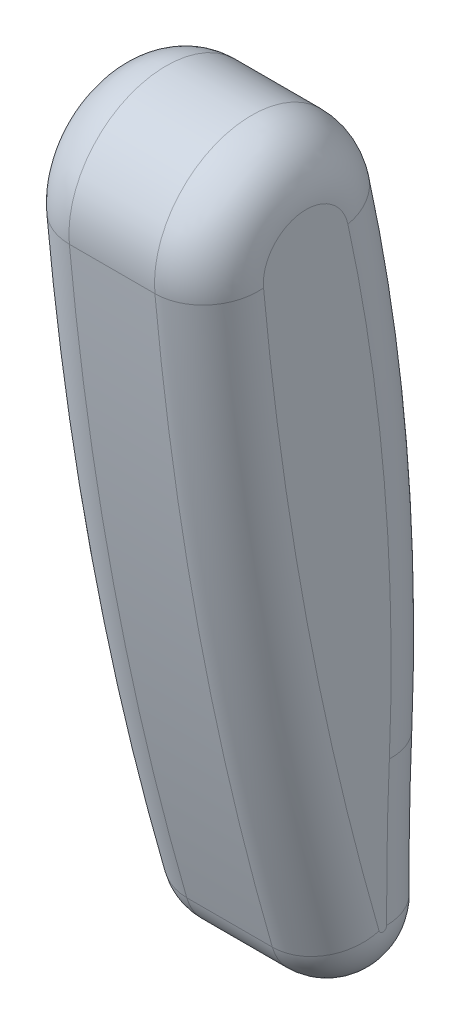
ISO-10303-21;
HEADER;
FILE_DESCRIPTION(('STEP AP214'),'2;1');
FILE_NAME('part.step','',(''),(''),'','','');
FILE_SCHEMA(('AUTOMOTIVE_DESIGN { 1 0 10303 214 1 1 1 1 }'));
ENDSEC;
DATA;
#1=APPLICATION_CONTEXT('core data for automotive mechanical design processes');
#2=APPLICATION_PROTOCOL_DEFINITION('international standard','automotive_design',2000,#1);
#3=PRODUCT_CONTEXT('',#1,'mechanical');
#4=PRODUCT('Part','Part','',(#3));
#5=PRODUCT_RELATED_PRODUCT_CATEGORY('part','',(#4));
#6=PRODUCT_DEFINITION_FORMATION('','',#4);
#7=PRODUCT_DEFINITION_CONTEXT('part definition',#1,'design');
#8=PRODUCT_DEFINITION('design','',#6,#7);
#9=PRODUCT_DEFINITION_SHAPE('','',#8);
#10=(LENGTH_UNIT() NAMED_UNIT(*) SI_UNIT(.MILLI.,.METRE.));
#11=(NAMED_UNIT(*) PLANE_ANGLE_UNIT() SI_UNIT($,.RADIAN.));
#12=(NAMED_UNIT(*) SI_UNIT($,.STERADIAN.) SOLID_ANGLE_UNIT());
#13=UNCERTAINTY_MEASURE_WITH_UNIT(LENGTH_MEASURE(1.E-05),#10,'distance_accuracy_value','');
#14=(GEOMETRIC_REPRESENTATION_CONTEXT(3) GLOBAL_UNCERTAINTY_ASSIGNED_CONTEXT((#13)) GLOBAL_UNIT_ASSIGNED_CONTEXT((#10,
#11,#12)) REPRESENTATION_CONTEXT('',''));
#15=CARTESIAN_POINT('',(0.,0.,0.));
#16=DIRECTION('',(0.,0.,1.));
#17=DIRECTION('',(1.,0.,0.));
#18=AXIS2_PLACEMENT_3D('',#15,#16,#17);
#19=CARTESIAN_POINT('',(-50.8,-559.10903574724,-2113.11328138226));
#20=DIRECTION('',(-1.,0.,0.));
#21=DIRECTION('',(0.,0.,-1.));
#22=AXIS2_PLACEMENT_3D('',#19,#20,#21);
#23=CYLINDRICAL_SURFACE('',#22,2209.8);
#24=DIRECTION('',(-1.,0.,0.));
#25=VECTOR('',#24,1.);
#26=CARTESIAN_POINT('',(-50.8,-761.528986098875,87.3962513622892));
#27=LINE('',#26,#25);
#28=CARTESIAN_POINT('',(-86.36,-761.528986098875,87.3962513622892));
#29=VERTEX_POINT('',#28);
#30=CARTESIAN_POINT('',(-142.24,-761.528986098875,87.3962513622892));
#31=VERTEX_POINT('',#30);
#32=EDGE_CURVE('E146',#29,#31,#27,.T.);
#33=ORIENTED_EDGE('',*,*,#32,.T.);
#34=CARTESIAN_POINT('',(-142.24,-559.10903574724,-2113.11328138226));
#35=DIRECTION('',(-1.,0.,0.));
#36=DIRECTION('',(0.,0.,1.));
#37=AXIS2_PLACEMENT_3D('',#34,#35,#36);
#38=CIRCLE('',#37,2209.8);
#39=CARTESIAN_POINT('',(-142.24,-1169.53967872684,10.7017929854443));
#40=VERTEX_POINT('',#39);
#41=EDGE_CURVE('E190',#40,#31,#38,.T.);
#42=ORIENTED_EDGE('',*,*,#41,.F.);
#43=DIRECTION('',(-1.,0.,0.));
#44=VECTOR('',#43,1.);
#45=CARTESIAN_POINT('',(-50.8,-1169.53967872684,10.7017929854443));
#46=LINE('',#45,#44);
#47=CARTESIAN_POINT('',(-86.36,-1169.53967872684,10.7017929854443));
#48=VERTEX_POINT('',#47);
#49=EDGE_CURVE('E162',#48,#40,#46,.T.);
#50=ORIENTED_EDGE('',*,*,#49,.F.);
#51=CARTESIAN_POINT('',(-86.36,-559.10903574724,-2113.11328138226));
#52=DIRECTION('',(-1.,0.,0.));
#53=DIRECTION('',(0.,0.,1.));
#54=AXIS2_PLACEMENT_3D('',#51,#52,#53);
#55=CIRCLE('',#54,2209.8);
#56=EDGE_CURVE('E193',#29,#48,#55,.F.);
#57=ORIENTED_EDGE('',*,*,#56,.F.);
#58=EDGE_LOOP('',(#33,#42,#50,#57));
#59=FACE_BOUND('',#58,.T.);
#60=ADVANCED_FACE('F35',(#59),#23,.T.);
#61=CARTESIAN_POINT('',(-50.8,-755.712320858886,24.1632188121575));
#62=DIRECTION('',(-1.,0.,0.));
#63=DIRECTION('',(0.,0.,-1.));
#64=AXIS2_PLACEMENT_3D('',#61,#62,#63);
#65=CYLINDRICAL_SURFACE('',#64,63.5000000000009);
#66=DIRECTION('',(-1.,0.,0.));
#67=VECTOR('',#66,1.);
#68=CARTESIAN_POINT('',(-50.8,-742.213802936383,-37.8854718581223));
#69=LINE('',#68,#67);
#70=CARTESIAN_POINT('',(-86.36,-742.213802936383,-37.8854718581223));
#71=VERTEX_POINT('',#70);
#72=CARTESIAN_POINT('',(-142.24,-742.213802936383,-37.8854718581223));
#73=VERTEX_POINT('',#72);
#74=EDGE_CURVE('E144',#71,#73,#69,.T.);
#75=ORIENTED_EDGE('',*,*,#74,.T.);
#76=CARTESIAN_POINT('',(-142.24,-755.712320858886,24.1632188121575));
#77=DIRECTION('',(-1.,0.,0.));
#78=DIRECTION('',(0.,0.,1.));
#79=AXIS2_PLACEMENT_3D('',#76,#77,#78);
#80=CIRCLE('',#79,63.5000000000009);
#81=EDGE_CURVE('E148',#31,#73,#80,.T.);
#82=ORIENTED_EDGE('',*,*,#81,.F.);
#83=ORIENTED_EDGE('',*,*,#32,.F.);
#84=CARTESIAN_POINT('',(-86.36,-755.712320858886,24.1632188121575));
#85=DIRECTION('',(-1.,0.,0.));
#86=DIRECTION('',(0.,0.,1.));
#87=AXIS2_PLACEMENT_3D('',#84,#85,#86);
#88=CIRCLE('',#87,63.5000000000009);
#89=EDGE_CURVE('E118',#71,#29,#88,.F.);
#90=ORIENTED_EDGE('',*,*,#89,.F.);
#91=EDGE_LOOP('',(#75,#82,#83,#90));
#92=FACE_BOUND('',#91,.T.);
#93=ADVANCED_FACE('F142',(#92),#65,.T.);
#94=CARTESIAN_POINT('',(-50.8,-1012.18416138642,1203.08834154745));
#95=DIRECTION('',(-1.,0.,0.));
#96=DIRECTION('',(0.,0.,-1.));
#97=AXIS2_PLACEMENT_3D('',#94,#95,#96);
#98=CYLINDRICAL_SURFACE('',#97,1270.);
#99=DIRECTION('',(-1.,0.,0.));
#100=VECTOR('',#99,1.);
#101=CARTESIAN_POINT('',(-50.8,-1067.28642691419,-65.7157175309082));
#102=LINE('',#101,#100);
#103=CARTESIAN_POINT('',(-86.36,-1067.28642691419,-65.7157175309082));
#104=VERTEX_POINT('',#103);
#105=CARTESIAN_POINT('',(-142.24,-1067.28642691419,-65.7157175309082));
#106=VERTEX_POINT('',#105);
#107=EDGE_CURVE('E154',#104,#106,#102,.T.);
#108=ORIENTED_EDGE('',*,*,#107,.T.);
#109=CARTESIAN_POINT('',(-142.24,-1012.18416138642,1203.08834154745));
#110=DIRECTION('',(-1.,0.,0.));
#111=DIRECTION('',(0.,0.,1.));
#112=AXIS2_PLACEMENT_3D('',#109,#110,#111);
#113=CIRCLE('',#112,1270.);
#114=EDGE_CURVE('E137',#73,#106,#113,.T.);
#115=ORIENTED_EDGE('',*,*,#114,.F.);
#116=ORIENTED_EDGE('',*,*,#74,.F.);
#117=CARTESIAN_POINT('',(-86.36,-1012.18416138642,1203.08834154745));
#118=DIRECTION('',(-1.,0.,0.));
#119=DIRECTION('',(0.,0.,1.));
#120=AXIS2_PLACEMENT_3D('',#117,#118,#119);
#121=CIRCLE('',#120,1270.);
#122=EDGE_CURVE('E129',#104,#71,#121,.F.);
#123=ORIENTED_EDGE('',*,*,#122,.F.);
#124=EDGE_LOOP('',(#108,#115,#116,#123));
#125=FACE_BOUND('',#124,.T.);
#126=ADVANCED_FACE('F151',(#125),#98,.T.);
#127=CARTESIAN_POINT('',(-50.8,-1147.29470222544,-1908.01427826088));
#128=DIRECTION('',(-1.,0.,0.));
#129=DIRECTION('',(0.,0.,-1.));
#130=AXIS2_PLACEMENT_3D('',#127,#128,#129);
#131=CYLINDRICAL_SURFACE('',#130,1844.03506229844);
#132=DIRECTION('',(-1.,0.,0.));
#133=VECTOR('',#132,1.);
#134=CARTESIAN_POINT('',(-50.8,-1158.77775860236,-64.01496958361));
#135=LINE('',#134,#133);
#136=CARTESIAN_POINT('',(-86.36,-1158.77775860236,-64.01496958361));
#137=VERTEX_POINT('',#136);
#138=CARTESIAN_POINT('',(-142.24,-1158.77775860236,-64.01496958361));
#139=VERTEX_POINT('',#138);
#140=EDGE_CURVE('E157',#137,#139,#135,.T.);
#141=ORIENTED_EDGE('',*,*,#140,.T.);
#142=CARTESIAN_POINT('',(-142.24,-1147.29470222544,-1908.01427826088));
#143=DIRECTION('',(-1.,0.,0.));
#144=DIRECTION('',(0.,0.,1.));
#145=AXIS2_PLACEMENT_3D('',#142,#143,#144);
#146=CIRCLE('',#145,1844.03506229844);
#147=EDGE_CURVE('E196',#106,#139,#146,.F.);
#148=ORIENTED_EDGE('',*,*,#147,.F.);
#149=ORIENTED_EDGE('',*,*,#107,.F.);
#150=CARTESIAN_POINT('',(-86.36,-1147.29470222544,-1908.01427826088));
#151=DIRECTION('',(-1.,0.,0.));
#152=DIRECTION('',(0.,0.,1.));
#153=AXIS2_PLACEMENT_3D('',#150,#151,#152);
#154=CIRCLE('',#153,1844.03506229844);
#155=EDGE_CURVE('E199',#137,#104,#154,.T.);
#156=ORIENTED_EDGE('',*,*,#155,.F.);
#157=EDGE_LOOP('',(#141,#148,#149,#156));
#158=FACE_BOUND('',#157,.T.);
#159=ADVANCED_FACE('F226',(#158),#131,.F.);
#160=CARTESIAN_POINT('',(-50.8,-1159.01501246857,-25.9157082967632));
#161=DIRECTION('',(-1.,0.,0.));
#162=DIRECTION('',(0.,0.,-1.));
#163=AXIS2_PLACEMENT_3D('',#160,#161,#162);
#164=CYLINDRICAL_SURFACE('',#163,38.100000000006);
#165=ORIENTED_EDGE('',*,*,#49,.T.);
#166=CARTESIAN_POINT('',(-142.24,-1159.01501246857,-25.9157082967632));
#167=DIRECTION('',(-1.,0.,0.));
#168=DIRECTION('',(0.,0.,1.));
#169=AXIS2_PLACEMENT_3D('',#166,#167,#168);
#170=CIRCLE('',#169,38.100000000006);
#171=EDGE_CURVE('E44',#139,#40,#170,.T.);
#172=ORIENTED_EDGE('',*,*,#171,.F.);
#173=ORIENTED_EDGE('',*,*,#140,.F.);
#174=CARTESIAN_POINT('',(-86.36,-1159.01501246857,-25.9157082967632));
#175=DIRECTION('',(-1.,0.,0.));
#176=DIRECTION('',(0.,0.,1.));
#177=AXIS2_PLACEMENT_3D('',#174,#175,#176);
#178=CIRCLE('',#177,38.100000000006);
#179=EDGE_CURVE('E11',#48,#137,#178,.F.);
#180=ORIENTED_EDGE('',*,*,#179,.F.);
#181=EDGE_LOOP('',(#165,#172,#173,#180));
#182=FACE_BOUND('',#181,.T.);
#183=ADVANCED_FACE('F230',(#182),#164,.T.);
#184=CARTESIAN_POINT('',(-50.8,-657.410678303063,-1044.47503128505));
#185=DIRECTION('',(1.,0.,0.));
#186=DIRECTION('',(0.,0.,1.));
#187=AXIS2_PLACEMENT_3D('',#184,#185,#186);
#188=PLANE('',#187);
#189=CARTESIAN_POINT('',(-50.8,-559.10903574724,-2113.11328138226));
#190=DIRECTION('',(-1.,0.,0.));
#191=DIRECTION('',(0.,0.,1.));
#192=AXIS2_PLACEMENT_3D('',#189,#190,#191);
#193=CIRCLE('',#192,2174.24);
#194=CARTESIAN_POINT('',(-50.8,-1159.71665688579,-23.4745415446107));
#195=VERTEX_POINT('',#194);
#196=CARTESIAN_POINT('',(-50.8,-758.271653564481,51.985753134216));
#197=VERTEX_POINT('',#196);
#198=EDGE_CURVE('E170',#195,#197,#193,.T.);
#199=ORIENTED_EDGE('',*,*,#198,.F.);
#200=CARTESIAN_POINT('',(-50.8,-1159.01501246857,-25.9157082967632));
#201=DIRECTION('',(-1.,0.,0.));
#202=DIRECTION('',(0.,0.,1.));
#203=AXIS2_PLACEMENT_3D('',#200,#201,#202);
#204=CIRCLE('',#203,2.54000000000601);
#205=CARTESIAN_POINT('',(-50.8,-1158.99919554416,-28.4556590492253));
#206=VERTEX_POINT('',#205);
#207=EDGE_CURVE('E147',#206,#195,#204,.T.);
#208=ORIENTED_EDGE('',*,*,#207,.F.);
#209=CARTESIAN_POINT('',(-50.8,-1147.29470222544,-1908.01427826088));
#210=DIRECTION('',(-1.,0.,0.));
#211=DIRECTION('',(0.,0.,1.));
#212=AXIS2_PLACEMENT_3D('',#209,#210,#211);
#213=CIRCLE('',#212,1879.59506229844);
#214=CARTESIAN_POINT('',(-50.8,-1065.74356347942,-30.1892038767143));
#215=VERTEX_POINT('',#214);
#216=EDGE_CURVE('E168',#215,#206,#213,.F.);
#217=ORIENTED_EDGE('',*,*,#216,.F.);
#218=CARTESIAN_POINT('',(-50.8,-1012.18416138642,1203.08834154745));
#219=DIRECTION('',(-1.,0.,0.));
#220=DIRECTION('',(0.,0.,1.));
#221=AXIS2_PLACEMENT_3D('',#218,#219,#220);
#222=CIRCLE('',#221,1234.44);
#223=CARTESIAN_POINT('',(-50.8,-749.772972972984,-3.13820508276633));
#224=VERTEX_POINT('',#223);
#225=EDGE_CURVE('E173',#224,#215,#222,.T.);
#226=ORIENTED_EDGE('',*,*,#225,.F.);
#227=CARTESIAN_POINT('',(-50.8,-755.712320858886,24.1632188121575));
#228=DIRECTION('',(-1.,0.,0.));
#229=DIRECTION('',(0.,0.,1.));
#230=AXIS2_PLACEMENT_3D('',#227,#228,#229);
#231=CIRCLE('',#230,27.9400000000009);
#232=EDGE_CURVE('E121',#197,#224,#231,.T.);
#233=ORIENTED_EDGE('',*,*,#232,.F.);
#234=EDGE_LOOP('',(#199,#208,#217,#226,#233));
#235=FACE_BOUND('',#234,.T.);
#236=ADVANCED_FACE('F270',(#235),#188,.T.);
#237=CARTESIAN_POINT('',(-177.8,-657.410678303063,-1044.47503128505));
#238=DIRECTION('',(1.,0.,0.));
#239=DIRECTION('',(0.,0.,1.));
#240=AXIS2_PLACEMENT_3D('',#237,#238,#239);
#241=PLANE('',#240);
#242=CARTESIAN_POINT('',(-177.8,-1012.18416138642,1203.08834154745));
#243=DIRECTION('',(-1.,0.,0.));
#244=DIRECTION('',(0.,0.,1.));
#245=AXIS2_PLACEMENT_3D('',#242,#243,#244);
#246=CIRCLE('',#245,1234.44);
#247=CARTESIAN_POINT('',(-177.8,-1065.74356347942,-30.1892038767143));
#248=VERTEX_POINT('',#247);
#249=CARTESIAN_POINT('',(-177.8,-749.772972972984,-3.13820508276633));
#250=VERTEX_POINT('',#249);
#251=EDGE_CURVE('E184',#248,#250,#246,.F.);
#252=ORIENTED_EDGE('',*,*,#251,.F.);
#253=CARTESIAN_POINT('',(-177.8,-1147.29470222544,-1908.01427826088));
#254=DIRECTION('',(-1.,0.,0.));
#255=DIRECTION('',(0.,0.,1.));
#256=AXIS2_PLACEMENT_3D('',#253,#254,#255);
#257=CIRCLE('',#256,1879.59506229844);
#258=CARTESIAN_POINT('',(-177.8,-1158.99919554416,-28.4556590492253));
#259=VERTEX_POINT('',#258);
#260=EDGE_CURVE('E178',#259,#248,#257,.T.);
#261=ORIENTED_EDGE('',*,*,#260,.F.);
#262=CARTESIAN_POINT('',(-177.8,-1159.01501246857,-25.9157082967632));
#263=DIRECTION('',(-1.,0.,0.));
#264=DIRECTION('',(0.,0.,1.));
#265=AXIS2_PLACEMENT_3D('',#262,#263,#264);
#266=CIRCLE('',#265,2.54000000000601);
#267=CARTESIAN_POINT('',(-177.8,-1159.71665688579,-23.4745415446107));
#268=VERTEX_POINT('',#267);
#269=EDGE_CURVE('E136',#268,#259,#266,.F.);
#270=ORIENTED_EDGE('',*,*,#269,.F.);
#271=CARTESIAN_POINT('',(-177.8,-559.10903574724,-2113.11328138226));
#272=DIRECTION('',(-1.,0.,0.));
#273=DIRECTION('',(0.,0.,1.));
#274=AXIS2_PLACEMENT_3D('',#271,#272,#273);
#275=CIRCLE('',#274,2174.24);
#276=CARTESIAN_POINT('',(-177.8,-758.271653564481,51.985753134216));
#277=VERTEX_POINT('',#276);
#278=EDGE_CURVE('E181',#277,#268,#275,.F.);
#279=ORIENTED_EDGE('',*,*,#278,.F.);
#280=CARTESIAN_POINT('',(-177.8,-755.712320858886,24.1632188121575));
#281=DIRECTION('',(-1.,0.,0.));
#282=DIRECTION('',(0.,0.,1.));
#283=AXIS2_PLACEMENT_3D('',#280,#281,#282);
#284=CIRCLE('',#283,27.9400000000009);
#285=EDGE_CURVE('E187',#250,#277,#284,.F.);
#286=ORIENTED_EDGE('',*,*,#285,.F.);
#287=EDGE_LOOP('',(#252,#261,#270,#279,#286));
#288=FACE_BOUND('',#287,.T.);
#289=ADVANCED_FACE('F220',(#288),#241,.F.);
#290=CARTESIAN_POINT('',(-86.36,-1147.29470222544,-1908.01427826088));
#291=DIRECTION('',(1.,0.,0.));
#292=DIRECTION('',(0.,0.,1.));
#293=AXIS2_PLACEMENT_3D('',#290,#291,#292);
#294=TOROIDAL_SURFACE('',#293,1879.59506229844,35.56);
#295=CARTESIAN_POINT('',(-86.36,-1065.74356347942,-30.1892038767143));
#296=DIRECTION('',(0.,-0.999058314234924,0.0433876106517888));
#297=DIRECTION('',(0.,0.0433876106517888,0.999058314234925));
#298=AXIS2_PLACEMENT_3D('',#295,#296,#297);
#299=CIRCLE('',#298,35.56);
#300=EDGE_CURVE('E131',#104,#215,#299,.T.);
#301=ORIENTED_EDGE('',*,*,#300,.T.);
#302=ORIENTED_EDGE('',*,*,#216,.T.);
#303=CARTESIAN_POINT('',(-86.36,-1158.99919554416,-28.4556590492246));
#304=DIRECTION('',(0.,0.999980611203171,0.00622713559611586));
#305=DIRECTION('',(0.,0.00622713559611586,-0.999980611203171));
#306=AXIS2_PLACEMENT_3D('',#303,#304,#305);
#307=CIRCLE('',#306,35.56);
#308=EDGE_CURVE('E59',#206,#137,#307,.T.);
#309=ORIENTED_EDGE('',*,*,#308,.T.);
#310=ORIENTED_EDGE('',*,*,#155,.T.);
#311=EDGE_LOOP('',(#301,#302,#309,#310));
#312=FACE_BOUND('',#311,.T.);
#313=ADVANCED_FACE('F264',(#312),#294,.T.);
#314=CARTESIAN_POINT('',(-86.36,-1159.01501246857,-25.9157082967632));
#315=DIRECTION('',(1.,0.,0.));
#316=DIRECTION('',(0.,0.,1.));
#317=AXIS2_PLACEMENT_3D('',#314,#315,#316);
#318=DEGENERATE_TOROIDAL_SURFACE('',#317,2.54000000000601,35.56,.T.);
#319=ORIENTED_EDGE('',*,*,#308,.F.);
#320=ORIENTED_EDGE('',*,*,#207,.T.);
#321=CARTESIAN_POINT('',(-86.36,-1159.71665688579,-23.4745415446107));
#322=DIRECTION('',(0.,-0.961089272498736,-0.27623795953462));
#323=DIRECTION('',(0.,-0.27623795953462,0.961089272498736));
#324=AXIS2_PLACEMENT_3D('',#321,#322,#323);
#325=CIRCLE('',#324,35.56);
#326=EDGE_CURVE('E125',#195,#48,#325,.T.);
#327=ORIENTED_EDGE('',*,*,#326,.T.);
#328=ORIENTED_EDGE('',*,*,#179,.T.);
#329=EDGE_LOOP('',(#319,#320,#327,#328));
#330=FACE_BOUND('',#329,.T.);
#331=ADVANCED_FACE('F262',(#330),#318,.T.);
#332=CARTESIAN_POINT('',(-86.36,-1012.18416138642,1203.08834154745));
#333=DIRECTION('',(1.,0.,0.));
#334=DIRECTION('',(0.,0.,1.));
#335=AXIS2_PLACEMENT_3D('',#332,#333,#334);
#336=TOROIDAL_SURFACE('',#335,1234.44,35.56);
#337=ORIENTED_EDGE('',*,*,#300,.F.);
#338=ORIENTED_EDGE('',*,*,#122,.T.);
#339=CARTESIAN_POINT('',(-86.36,-749.772972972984,-3.13820508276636));
#340=DIRECTION('',(0.,-0.977144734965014,-0.212575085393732));
#341=DIRECTION('',(0.,-0.212575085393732,0.977144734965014));
#342=AXIS2_PLACEMENT_3D('',#339,#340,#341);
#343=CIRCLE('',#342,35.56);
#344=EDGE_CURVE('E114',#71,#224,#343,.T.);
#345=ORIENTED_EDGE('',*,*,#344,.T.);
#346=ORIENTED_EDGE('',*,*,#225,.T.);
#347=EDGE_LOOP('',(#337,#338,#345,#346));
#348=FACE_BOUND('',#347,.T.);
#349=ADVANCED_FACE('F130',(#348),#336,.T.);
#350=CARTESIAN_POINT('',(-86.36,-559.10903574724,-2113.11328138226));
#351=DIRECTION('',(1.,0.,0.));
#352=DIRECTION('',(0.,0.,1.));
#353=AXIS2_PLACEMENT_3D('',#350,#351,#352);
#354=TOROIDAL_SURFACE('',#353,2174.24,35.56);
#355=ORIENTED_EDGE('',*,*,#326,.F.);
#356=ORIENTED_EDGE('',*,*,#198,.T.);
#357=CARTESIAN_POINT('',(-86.36,-758.271653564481,51.985753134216));
#358=DIRECTION('',(0.,-0.995795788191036,-0.0916010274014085));
#359=DIRECTION('',(0.,-0.0916010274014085,0.995795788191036));
#360=AXIS2_PLACEMENT_3D('',#357,#358,#359);
#361=CIRCLE('',#360,35.56);
#362=EDGE_CURVE('E126',#197,#29,#361,.T.);
#363=ORIENTED_EDGE('',*,*,#362,.T.);
#364=ORIENTED_EDGE('',*,*,#56,.T.);
#365=EDGE_LOOP('',(#355,#356,#363,#364));
#366=FACE_BOUND('',#365,.T.);
#367=ADVANCED_FACE('F256',(#366),#354,.T.);
#368=CARTESIAN_POINT('',(-86.36,-755.712320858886,24.1632188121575));
#369=DIRECTION('',(1.,0.,0.));
#370=DIRECTION('',(0.,0.,1.));
#371=AXIS2_PLACEMENT_3D('',#368,#369,#370);
#372=DEGENERATE_TOROIDAL_SURFACE('',#371,27.9400000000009,35.56,.T.);
#373=ORIENTED_EDGE('',*,*,#344,.F.);
#374=ORIENTED_EDGE('',*,*,#89,.T.);
#375=ORIENTED_EDGE('',*,*,#362,.F.);
#376=ORIENTED_EDGE('',*,*,#232,.T.);
#377=EDGE_LOOP('',(#373,#374,#375,#376));
#378=FACE_BOUND('',#377,.T.);
#379=ADVANCED_FACE('F116',(#378),#372,.T.);
#380=CARTESIAN_POINT('',(-142.24,-1147.29470222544,-1908.01427826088));
#381=DIRECTION('',(1.,0.,0.));
#382=DIRECTION('',(0.,0.,1.));
#383=AXIS2_PLACEMENT_3D('',#380,#381,#382);
#384=TOROIDAL_SURFACE('',#383,1879.59506229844,35.56);
#385=CARTESIAN_POINT('',(-142.24,-1065.74356347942,-30.1892038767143));
#386=DIRECTION('',(0.,-0.999058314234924,0.0433876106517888));
#387=DIRECTION('',(0.,0.0433876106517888,0.999058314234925));
#388=AXIS2_PLACEMENT_3D('',#385,#386,#387);
#389=CIRCLE('',#388,35.56);
#390=EDGE_CURVE('E211',#248,#106,#389,.T.);
#391=ORIENTED_EDGE('',*,*,#390,.T.);
#392=ORIENTED_EDGE('',*,*,#147,.T.);
#393=CARTESIAN_POINT('',(-142.24,-1158.99919554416,-28.4556590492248));
#394=DIRECTION('',(0.,0.999980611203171,0.0062271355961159));
#395=DIRECTION('',(0.,0.0062271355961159,-0.999980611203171));
#396=AXIS2_PLACEMENT_3D('',#393,#394,#395);
#397=CIRCLE('',#396,35.56);
#398=EDGE_CURVE('E39',#139,#259,#397,.T.);
#399=ORIENTED_EDGE('',*,*,#398,.T.);
#400=ORIENTED_EDGE('',*,*,#260,.T.);
#401=EDGE_LOOP('',(#391,#392,#399,#400));
#402=FACE_BOUND('',#401,.T.);
#403=ADVANCED_FACE('F37',(#402),#384,.T.);
#404=CARTESIAN_POINT('',(-142.24,-1159.01501246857,-25.9157082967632));
#405=DIRECTION('',(1.,0.,0.));
#406=DIRECTION('',(0.,0.,1.));
#407=AXIS2_PLACEMENT_3D('',#404,#405,#406);
#408=DEGENERATE_TOROIDAL_SURFACE('',#407,2.54000000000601,35.56,.T.);
#409=ORIENTED_EDGE('',*,*,#398,.F.);
#410=ORIENTED_EDGE('',*,*,#171,.T.);
#411=CARTESIAN_POINT('',(-142.24,-1159.71665688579,-23.4745415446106));
#412=DIRECTION('',(0.,-0.961089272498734,-0.276237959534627));
#413=DIRECTION('',(0.,-0.276237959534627,0.961089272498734));
#414=AXIS2_PLACEMENT_3D('',#411,#412,#413);
#415=CIRCLE('',#414,35.56);
#416=EDGE_CURVE('E210',#40,#268,#415,.T.);
#417=ORIENTED_EDGE('',*,*,#416,.T.);
#418=ORIENTED_EDGE('',*,*,#269,.T.);
#419=EDGE_LOOP('',(#409,#410,#417,#418));
#420=FACE_BOUND('',#419,.T.);
#421=ADVANCED_FACE('F217',(#420),#408,.T.);
#422=CARTESIAN_POINT('',(-142.24,-1012.18416138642,1203.08834154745));
#423=DIRECTION('',(1.,0.,0.));
#424=DIRECTION('',(0.,0.,1.));
#425=AXIS2_PLACEMENT_3D('',#422,#423,#424);
#426=TOROIDAL_SURFACE('',#425,1234.44,35.56);
#427=ORIENTED_EDGE('',*,*,#390,.F.);
#428=ORIENTED_EDGE('',*,*,#251,.T.);
#429=CARTESIAN_POINT('',(-142.24,-749.772972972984,-3.13820508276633));
#430=DIRECTION('',(0.,-0.977144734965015,-0.212575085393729));
#431=DIRECTION('',(0.,-0.212575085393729,0.977144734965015));
#432=AXIS2_PLACEMENT_3D('',#429,#430,#431);
#433=CIRCLE('',#432,35.56);
#434=EDGE_CURVE('E208',#250,#73,#433,.T.);
#435=ORIENTED_EDGE('',*,*,#434,.T.);
#436=ORIENTED_EDGE('',*,*,#114,.T.);
#437=EDGE_LOOP('',(#427,#428,#435,#436));
#438=FACE_BOUND('',#437,.T.);
#439=ADVANCED_FACE('F223',(#438),#426,.T.);
#440=CARTESIAN_POINT('',(-142.24,-559.10903574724,-2113.11328138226));
#441=DIRECTION('',(1.,0.,0.));
#442=DIRECTION('',(0.,0.,1.));
#443=AXIS2_PLACEMENT_3D('',#440,#441,#442);
#444=TOROIDAL_SURFACE('',#443,2174.24,35.56);
#445=ORIENTED_EDGE('',*,*,#416,.F.);
#446=ORIENTED_EDGE('',*,*,#41,.T.);
#447=CARTESIAN_POINT('',(-142.24,-758.271653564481,51.985753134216));
#448=DIRECTION('',(0.,-0.995795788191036,-0.0916010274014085));
#449=DIRECTION('',(0.,-0.0916010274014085,0.995795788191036));
#450=AXIS2_PLACEMENT_3D('',#447,#448,#449);
#451=CIRCLE('',#450,35.56);
#452=EDGE_CURVE('E206',#31,#277,#451,.T.);
#453=ORIENTED_EDGE('',*,*,#452,.T.);
#454=ORIENTED_EDGE('',*,*,#278,.T.);
#455=EDGE_LOOP('',(#445,#446,#453,#454));
#456=FACE_BOUND('',#455,.T.);
#457=ADVANCED_FACE('F235',(#456),#444,.T.);
#458=CARTESIAN_POINT('',(-142.24,-755.712320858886,24.1632188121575));
#459=DIRECTION('',(1.,0.,0.));
#460=DIRECTION('',(0.,0.,1.));
#461=AXIS2_PLACEMENT_3D('',#458,#459,#460);
#462=DEGENERATE_TOROIDAL_SURFACE('',#461,27.9400000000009,35.56,.T.);
#463=ORIENTED_EDGE('',*,*,#434,.F.);
#464=ORIENTED_EDGE('',*,*,#285,.T.);
#465=ORIENTED_EDGE('',*,*,#452,.F.);
#466=ORIENTED_EDGE('',*,*,#81,.T.);
#467=EDGE_LOOP('',(#463,#464,#465,#466));
#468=FACE_BOUND('',#467,.T.);
#469=ADVANCED_FACE('F237',(#468),#462,.T.);
#470=CLOSED_SHELL('',(#60,#93,#126,#159,#183,#236,#289,#313,#331,#349,#367,#379,#403,#421,#439,
#457,#469));
#471=MANIFOLD_SOLID_BREP('B2',#470);
#472=ADVANCED_BREP_SHAPE_REPRESENTATION('',(#18,#471),#14);
#473=SHAPE_DEFINITION_REPRESENTATION(#9,#472);
ENDSEC;
END-ISO-10303-21;
